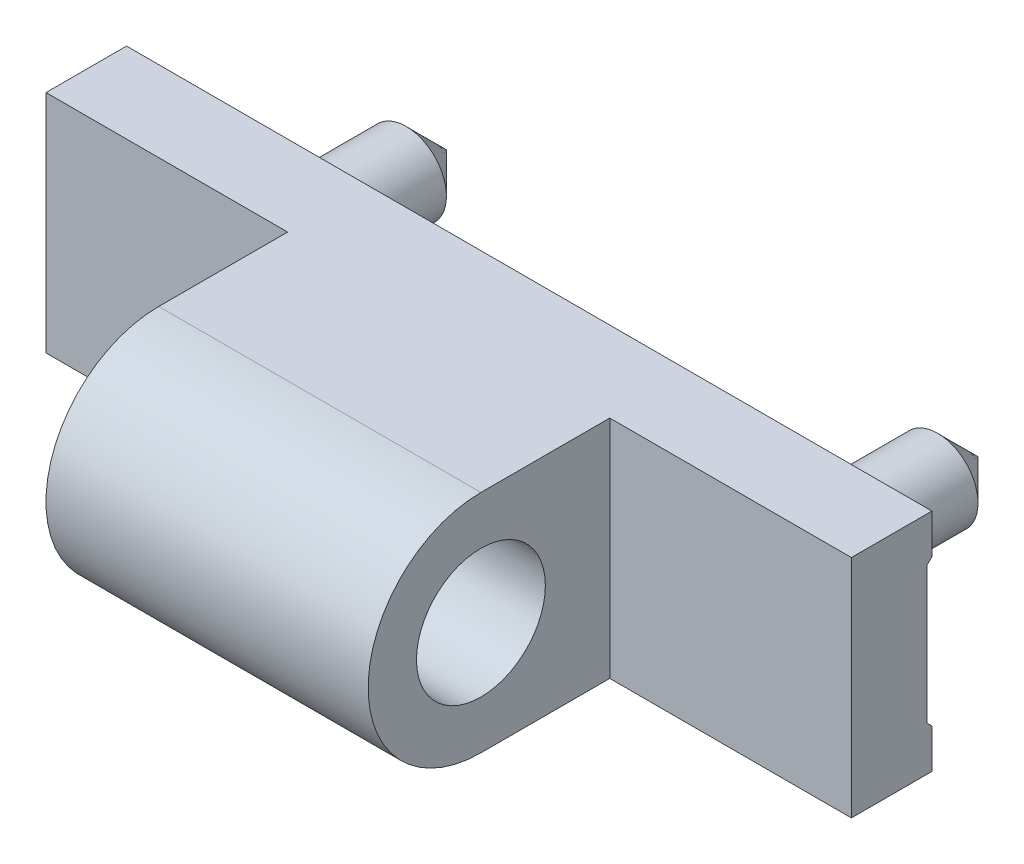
ISO-10303-21;
HEADER;
FILE_DESCRIPTION(('STEP AP214'),'2;1');
FILE_NAME('part.step','',(''),(''),'','','');
FILE_SCHEMA(('AUTOMOTIVE_DESIGN { 1 0 10303 214 1 1 1 1 }'));
ENDSEC;
DATA;
#1=APPLICATION_CONTEXT('core data for automotive mechanical design processes');
#2=APPLICATION_PROTOCOL_DEFINITION('international standard','automotive_design',2000,#1);
#3=PRODUCT_CONTEXT('',#1,'mechanical');
#4=PRODUCT('Part','Part','',(#3));
#5=PRODUCT_RELATED_PRODUCT_CATEGORY('part','',(#4));
#6=PRODUCT_DEFINITION_FORMATION('','',#4);
#7=PRODUCT_DEFINITION_CONTEXT('part definition',#1,'design');
#8=PRODUCT_DEFINITION('design','',#6,#7);
#9=PRODUCT_DEFINITION_SHAPE('','',#8);
#10=(LENGTH_UNIT() NAMED_UNIT(*) SI_UNIT(.MILLI.,.METRE.));
#11=(NAMED_UNIT(*) PLANE_ANGLE_UNIT() SI_UNIT($,.RADIAN.));
#12=(NAMED_UNIT(*) SI_UNIT($,.STERADIAN.) SOLID_ANGLE_UNIT());
#13=UNCERTAINTY_MEASURE_WITH_UNIT(LENGTH_MEASURE(1.E-05),#10,'distance_accuracy_value','');
#14=(GEOMETRIC_REPRESENTATION_CONTEXT(3) GLOBAL_UNCERTAINTY_ASSIGNED_CONTEXT((#13)) GLOBAL_UNIT_ASSIGNED_CONTEXT((#10,
#11,#12)) REPRESENTATION_CONTEXT('',''));
#15=CARTESIAN_POINT('',(0.,0.,0.));
#16=DIRECTION('',(0.,0.,1.));
#17=DIRECTION('',(1.,0.,0.));
#18=AXIS2_PLACEMENT_3D('',#15,#16,#17);
#19=CARTESIAN_POINT('',(41.5,0.,13.));
#20=DIRECTION('',(-1.,0.,0.));
#21=DIRECTION('',(0.,-1.,0.));
#22=AXIS2_PLACEMENT_3D('',#19,#20,#21);
#23=CYLINDRICAL_SURFACE('',#22,7.);
#24=CARTESIAN_POINT('',(26.5,0.,13.));
#25=DIRECTION('',(1.,0.,0.));
#26=DIRECTION('',(0.,1.,0.));
#27=AXIS2_PLACEMENT_3D('',#24,#25,#26);
#28=CIRCLE('',#27,7.);
#29=CARTESIAN_POINT('',(26.5,7.,13.));
#30=VERTEX_POINT('',#29);
#31=CARTESIAN_POINT('',(26.5,-7.,13.));
#32=VERTEX_POINT('',#31);
#33=EDGE_CURVE('E146',#30,#32,#28,.T.);
#34=ORIENTED_EDGE('',*,*,#33,.F.);
#35=DIRECTION('',(-1.,0.,0.));
#36=VECTOR('',#35,1.);
#37=CARTESIAN_POINT('',(41.5,7.,13.));
#38=LINE('',#37,#36);
#39=CARTESIAN_POINT('',(6.5,7.,13.));
#40=VERTEX_POINT('',#39);
#41=EDGE_CURVE('E165',#30,#40,#38,.T.);
#42=ORIENTED_EDGE('',*,*,#41,.T.);
#43=CARTESIAN_POINT('',(6.5,0.,13.));
#44=DIRECTION('',(-1.,0.,0.));
#45=DIRECTION('',(0.,-1.,0.));
#46=AXIS2_PLACEMENT_3D('',#43,#44,#45);
#47=CIRCLE('',#46,7.);
#48=CARTESIAN_POINT('',(6.5,-7.,13.));
#49=VERTEX_POINT('',#48);
#50=EDGE_CURVE('E141',#49,#40,#47,.T.);
#51=ORIENTED_EDGE('',*,*,#50,.F.);
#52=DIRECTION('',(-1.,0.,0.));
#53=VECTOR('',#52,1.);
#54=CARTESIAN_POINT('',(41.5,-7.,13.));
#55=LINE('',#54,#53);
#56=EDGE_CURVE('E199',#32,#49,#55,.T.);
#57=ORIENTED_EDGE('',*,*,#56,.F.);
#58=EDGE_LOOP('',(#34,#42,#51,#57));
#59=FACE_BOUND('',#58,.T.);
#60=ADVANCED_FACE('F14',(#59),#23,.T.);
#61=CARTESIAN_POINT('',(41.5,-7.,13.));
#62=DIRECTION('',(0.,1.,0.));
#63=DIRECTION('',(-1.,0.,0.));
#64=AXIS2_PLACEMENT_3D('',#61,#62,#63);
#65=PLANE('',#64);
#66=DIRECTION('',(0.,0.,-1.));
#67=VECTOR('',#66,1.);
#68=CARTESIAN_POINT('',(6.5,-7.,25.));
#69=LINE('',#68,#67);
#70=CARTESIAN_POINT('',(6.5,-7.,5.));
#71=VERTEX_POINT('',#70);
#72=EDGE_CURVE('E131',#49,#71,#69,.T.);
#73=ORIENTED_EDGE('',*,*,#72,.T.);
#74=DIRECTION('',(1.,0.,0.));
#75=VECTOR('',#74,1.);
#76=CARTESIAN_POINT('',(-8.5,-7.,5.));
#77=LINE('',#76,#75);
#78=CARTESIAN_POINT('',(-8.5,-7.,5.));
#79=VERTEX_POINT('',#78);
#80=EDGE_CURVE('E127',#79,#71,#77,.T.);
#81=ORIENTED_EDGE('',*,*,#80,.F.);
#82=DIRECTION('',(0.,0.,-1.));
#83=VECTOR('',#82,1.);
#84=CARTESIAN_POINT('',(-8.5,-7.,13.));
#85=LINE('',#84,#83);
#86=CARTESIAN_POINT('',(-8.5,-7.,0.));
#87=VERTEX_POINT('',#86);
#88=EDGE_CURVE('E148',#79,#87,#85,.T.);
#89=ORIENTED_EDGE('',*,*,#88,.T.);
#90=DIRECTION('',(-1.,0.,0.));
#91=VECTOR('',#90,1.);
#92=CARTESIAN_POINT('',(41.5,-7.,0.));
#93=LINE('',#92,#91);
#94=CARTESIAN_POINT('',(41.5,-7.,0.));
#95=VERTEX_POINT('',#94);
#96=EDGE_CURVE('E196',#95,#87,#93,.T.);
#97=ORIENTED_EDGE('',*,*,#96,.F.);
#98=DIRECTION('',(0.,0.,-1.));
#99=VECTOR('',#98,1.);
#100=CARTESIAN_POINT('',(41.5,-7.,13.));
#101=LINE('',#100,#99);
#102=CARTESIAN_POINT('',(41.5,-7.,5.));
#103=VERTEX_POINT('',#102);
#104=EDGE_CURVE('E149',#103,#95,#101,.T.);
#105=ORIENTED_EDGE('',*,*,#104,.F.);
#106=DIRECTION('',(1.,0.,0.));
#107=VECTOR('',#106,1.);
#108=CARTESIAN_POINT('',(26.5,-7.,5.));
#109=LINE('',#108,#107);
#110=CARTESIAN_POINT('',(26.5,-7.,5.));
#111=VERTEX_POINT('',#110);
#112=EDGE_CURVE('E28',#111,#103,#109,.T.);
#113=ORIENTED_EDGE('',*,*,#112,.F.);
#114=DIRECTION('',(0.,0.,-1.));
#115=VECTOR('',#114,1.);
#116=CARTESIAN_POINT('',(26.5,-7.,25.));
#117=LINE('',#116,#115);
#118=EDGE_CURVE('E134',#32,#111,#117,.T.);
#119=ORIENTED_EDGE('',*,*,#118,.F.);
#120=ORIENTED_EDGE('',*,*,#56,.T.);
#121=EDGE_LOOP('',(#73,#81,#89,#97,#105,#113,#119,#120));
#122=FACE_BOUND('',#121,.T.);
#123=ADVANCED_FACE('F254',(#122),#65,.F.);
#124=CARTESIAN_POINT('',(41.5,7.,0.));
#125=DIRECTION('',(0.,-1.,0.));
#126=DIRECTION('',(1.,0.,0.));
#127=AXIS2_PLACEMENT_3D('',#124,#125,#126);
#128=PLANE('',#127);
#129=DIRECTION('',(-1.,0.,0.));
#130=VECTOR('',#129,1.);
#131=CARTESIAN_POINT('',(41.5,7.,5.));
#132=LINE('',#131,#130);
#133=CARTESIAN_POINT('',(41.5,7.,5.));
#134=VERTEX_POINT('',#133);
#135=CARTESIAN_POINT('',(26.5,7.,5.));
#136=VERTEX_POINT('',#135);
#137=EDGE_CURVE('E137',#134,#136,#132,.T.);
#138=ORIENTED_EDGE('',*,*,#137,.F.);
#139=DIRECTION('',(0.,0.,1.));
#140=VECTOR('',#139,1.);
#141=CARTESIAN_POINT('',(41.5,7.,0.));
#142=LINE('',#141,#140);
#143=CARTESIAN_POINT('',(41.5,7.,0.));
#144=VERTEX_POINT('',#143);
#145=EDGE_CURVE('E162',#144,#134,#142,.T.);
#146=ORIENTED_EDGE('',*,*,#145,.F.);
#147=DIRECTION('',(-1.,0.,0.));
#148=VECTOR('',#147,1.);
#149=CARTESIAN_POINT('',(41.5,7.,0.));
#150=LINE('',#149,#148);
#151=CARTESIAN_POINT('',(-8.5,7.,0.));
#152=VERTEX_POINT('',#151);
#153=EDGE_CURVE('E181',#144,#152,#150,.T.);
#154=ORIENTED_EDGE('',*,*,#153,.T.);
#155=DIRECTION('',(0.,0.,1.));
#156=VECTOR('',#155,1.);
#157=CARTESIAN_POINT('',(-8.5,7.,0.));
#158=LINE('',#157,#156);
#159=CARTESIAN_POINT('',(-8.5,7.,5.));
#160=VERTEX_POINT('',#159);
#161=EDGE_CURVE('E152',#152,#160,#158,.T.);
#162=ORIENTED_EDGE('',*,*,#161,.T.);
#163=CARTESIAN_POINT('',(6.5,7.,5.));
#164=VERTEX_POINT('',#163);
#165=EDGE_CURVE('E36',#164,#160,#132,.T.);
#166=ORIENTED_EDGE('',*,*,#165,.F.);
#167=DIRECTION('',(0.,0.,-1.));
#168=VECTOR('',#167,1.);
#169=CARTESIAN_POINT('',(6.5,7.,0.));
#170=LINE('',#169,#168);
#171=EDGE_CURVE('E204',#40,#164,#170,.T.);
#172=ORIENTED_EDGE('',*,*,#171,.F.);
#173=ORIENTED_EDGE('',*,*,#41,.F.);
#174=DIRECTION('',(0.,0.,1.));
#175=VECTOR('',#174,1.);
#176=CARTESIAN_POINT('',(26.5,7.,0.));
#177=LINE('',#176,#175);
#178=EDGE_CURVE('E206',#136,#30,#177,.T.);
#179=ORIENTED_EDGE('',*,*,#178,.F.);
#180=EDGE_LOOP('',(#138,#146,#154,#162,#166,#172,#173,#179));
#181=FACE_BOUND('',#180,.T.);
#182=ADVANCED_FACE('F239',(#181),#128,.F.);
#183=CARTESIAN_POINT('',(41.5,0.,13.));
#184=DIRECTION('',(1.,0.,0.));
#185=DIRECTION('',(0.,1.,0.));
#186=AXIS2_PLACEMENT_3D('',#183,#184,#185);
#187=PLANE('',#186);
#188=ORIENTED_EDGE('',*,*,#145,.T.);
#189=DIRECTION('',(0.,1.,0.));
#190=VECTOR('',#189,1.);
#191=CARTESIAN_POINT('',(41.5,-7.,5.));
#192=LINE('',#191,#190);
#193=EDGE_CURVE('E125',#103,#134,#192,.T.);
#194=ORIENTED_EDGE('',*,*,#193,.F.);
#195=ORIENTED_EDGE('',*,*,#104,.T.);
#196=DIRECTION('',(0.,1.,0.));
#197=VECTOR('',#196,1.);
#198=CARTESIAN_POINT('',(41.5,-7.,0.));
#199=LINE('',#198,#197);
#200=CARTESIAN_POINT('',(41.5,-4.55,0.));
#201=VERTEX_POINT('',#200);
#202=EDGE_CURVE('E151',#95,#201,#199,.T.);
#203=ORIENTED_EDGE('',*,*,#202,.T.);
#204=DIRECTION('',(0.,0.707106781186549,0.707106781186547));
#205=VECTOR('',#204,1.);
#206=CARTESIAN_POINT('',(41.5,-4.55,0.));
#207=LINE('',#206,#205);
#208=CARTESIAN_POINT('',(41.5,-4.25,0.3));
#209=VERTEX_POINT('',#208);
#210=EDGE_CURVE('E154',#201,#209,#207,.T.);
#211=ORIENTED_EDGE('',*,*,#210,.T.);
#212=DIRECTION('',(0.,1.,0.));
#213=VECTOR('',#212,1.);
#214=CARTESIAN_POINT('',(41.5,-4.25,0.3));
#215=LINE('',#214,#213);
#216=CARTESIAN_POINT('',(41.5,4.25,0.3));
#217=VERTEX_POINT('',#216);
#218=EDGE_CURVE('E156',#209,#217,#215,.T.);
#219=ORIENTED_EDGE('',*,*,#218,.T.);
#220=DIRECTION('',(0.,0.707106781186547,-0.707106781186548));
#221=VECTOR('',#220,1.);
#222=CARTESIAN_POINT('',(41.5,4.25,0.3));
#223=LINE('',#222,#221);
#224=CARTESIAN_POINT('',(41.5,4.55,0.));
#225=VERTEX_POINT('',#224);
#226=EDGE_CURVE('E158',#217,#225,#223,.T.);
#227=ORIENTED_EDGE('',*,*,#226,.T.);
#228=DIRECTION('',(0.,1.,0.));
#229=VECTOR('',#228,1.);
#230=CARTESIAN_POINT('',(41.5,4.55,0.));
#231=LINE('',#230,#229);
#232=EDGE_CURVE('E160',#225,#144,#231,.T.);
#233=ORIENTED_EDGE('',*,*,#232,.T.);
#234=EDGE_LOOP('',(#188,#194,#195,#203,#211,#219,#227,#233));
#235=FACE_BOUND('',#234,.T.);
#236=ADVANCED_FACE('F242',(#235),#187,.T.);
#237=CARTESIAN_POINT('',(-8.5,0.,13.));
#238=DIRECTION('',(1.,0.,0.));
#239=DIRECTION('',(0.,1.,0.));
#240=AXIS2_PLACEMENT_3D('',#237,#238,#239);
#241=PLANE('',#240);
#242=DIRECTION('',(0.,-1.,0.));
#243=VECTOR('',#242,1.);
#244=CARTESIAN_POINT('',(-8.5,0.,5.));
#245=LINE('',#244,#243);
#246=EDGE_CURVE('E202',#160,#79,#245,.T.);
#247=ORIENTED_EDGE('',*,*,#246,.F.);
#248=ORIENTED_EDGE('',*,*,#161,.F.);
#249=DIRECTION('',(0.,1.,0.));
#250=VECTOR('',#249,1.);
#251=CARTESIAN_POINT('',(-8.5,4.55,0.));
#252=LINE('',#251,#250);
#253=CARTESIAN_POINT('',(-8.5,4.55,0.));
#254=VERTEX_POINT('',#253);
#255=EDGE_CURVE('E175',#254,#152,#252,.T.);
#256=ORIENTED_EDGE('',*,*,#255,.F.);
#257=DIRECTION('',(0.,0.707106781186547,-0.707106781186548));
#258=VECTOR('',#257,1.);
#259=CARTESIAN_POINT('',(-8.5,4.25,0.3));
#260=LINE('',#259,#258);
#261=CARTESIAN_POINT('',(-8.5,4.25,0.3));
#262=VERTEX_POINT('',#261);
#263=EDGE_CURVE('E173',#262,#254,#260,.T.);
#264=ORIENTED_EDGE('',*,*,#263,.F.);
#265=DIRECTION('',(0.,1.,0.));
#266=VECTOR('',#265,1.);
#267=CARTESIAN_POINT('',(-8.5,-4.25,0.3));
#268=LINE('',#267,#266);
#269=CARTESIAN_POINT('',(-8.5,-4.25,0.3));
#270=VERTEX_POINT('',#269);
#271=EDGE_CURVE('E171',#270,#262,#268,.T.);
#272=ORIENTED_EDGE('',*,*,#271,.F.);
#273=DIRECTION('',(0.,0.707106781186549,0.707106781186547));
#274=VECTOR('',#273,1.);
#275=CARTESIAN_POINT('',(-8.5,-4.55,0.));
#276=LINE('',#275,#274);
#277=CARTESIAN_POINT('',(-8.5,-4.55,0.));
#278=VERTEX_POINT('',#277);
#279=EDGE_CURVE('E169',#278,#270,#276,.T.);
#280=ORIENTED_EDGE('',*,*,#279,.F.);
#281=DIRECTION('',(0.,1.,0.));
#282=VECTOR('',#281,1.);
#283=CARTESIAN_POINT('',(-8.5,-7.,0.));
#284=LINE('',#283,#282);
#285=EDGE_CURVE('E167',#87,#278,#284,.T.);
#286=ORIENTED_EDGE('',*,*,#285,.F.);
#287=ORIENTED_EDGE('',*,*,#88,.F.);
#288=EDGE_LOOP('',(#247,#248,#256,#264,#272,#280,#286,#287));
#289=FACE_BOUND('',#288,.T.);
#290=ADVANCED_FACE('F230',(#289),#241,.F.);
#291=CARTESIAN_POINT('',(41.5,-7.,0.));
#292=DIRECTION('',(0.,0.,1.));
#293=DIRECTION('',(1.,0.,0.));
#294=AXIS2_PLACEMENT_3D('',#291,#292,#293);
#295=PLANE('',#294);
#296=ORIENTED_EDGE('',*,*,#285,.T.);
#297=DIRECTION('',(-1.,0.,0.));
#298=VECTOR('',#297,1.);
#299=CARTESIAN_POINT('',(41.5,-4.55,0.));
#300=LINE('',#299,#298);
#301=EDGE_CURVE('E193',#201,#278,#300,.T.);
#302=ORIENTED_EDGE('',*,*,#301,.F.);
#303=ORIENTED_EDGE('',*,*,#202,.F.);
#304=ORIENTED_EDGE('',*,*,#96,.T.);
#305=EDGE_LOOP('',(#296,#302,#303,#304));
#306=FACE_BOUND('',#305,.T.);
#307=ADVANCED_FACE('F251',(#306),#295,.F.);
#308=CARTESIAN_POINT('',(41.5,-4.55,0.));
#309=DIRECTION('',(0.,-0.707106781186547,0.707106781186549));
#310=DIRECTION('',(0.,-0.707106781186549,-0.707106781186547));
#311=AXIS2_PLACEMENT_3D('',#308,#309,#310);
#312=PLANE('',#311);
#313=ORIENTED_EDGE('',*,*,#279,.T.);
#314=DIRECTION('',(-1.,0.,0.));
#315=VECTOR('',#314,1.);
#316=CARTESIAN_POINT('',(41.5,-4.25,0.3));
#317=LINE('',#316,#315);
#318=EDGE_CURVE('E190',#209,#270,#317,.T.);
#319=ORIENTED_EDGE('',*,*,#318,.F.);
#320=ORIENTED_EDGE('',*,*,#210,.F.);
#321=ORIENTED_EDGE('',*,*,#301,.T.);
#322=EDGE_LOOP('',(#313,#319,#320,#321));
#323=FACE_BOUND('',#322,.T.);
#324=ADVANCED_FACE('F216',(#323),#312,.F.);
#325=CARTESIAN_POINT('',(41.5,-4.25,0.3));
#326=DIRECTION('',(0.,0.,1.));
#327=DIRECTION('',(1.,0.,0.));
#328=AXIS2_PLACEMENT_3D('',#325,#326,#327);
#329=PLANE('',#328);
#330=CARTESIAN_POINT('',(0.,0.,0.3));
#331=DIRECTION('',(0.,0.,1.));
#332=DIRECTION('',(1.,0.,0.));
#333=AXIS2_PLACEMENT_3D('',#330,#331,#332);
#334=CIRCLE('',#333,2.5);
#335=CARTESIAN_POINT('',(2.5,0.,0.3));
#336=VERTEX_POINT('',#335);
#337=EDGE_CURVE('E9',#336,#336,#334,.F.);
#338=ORIENTED_EDGE('',*,*,#337,.F.);
#339=EDGE_LOOP('',(#338));
#340=FACE_BOUND('',#339,.T.);
#341=CARTESIAN_POINT('',(33.,0.,0.3));
#342=DIRECTION('',(0.,0.,1.));
#343=DIRECTION('',(1.,0.,0.));
#344=AXIS2_PLACEMENT_3D('',#341,#342,#343);
#345=CIRCLE('',#344,2.5);
#346=CARTESIAN_POINT('',(35.5,0.,0.3));
#347=VERTEX_POINT('',#346);
#348=EDGE_CURVE('E21',#347,#347,#345,.F.);
#349=ORIENTED_EDGE('',*,*,#348,.F.);
#350=EDGE_LOOP('',(#349));
#351=FACE_BOUND('',#350,.T.);
#352=ORIENTED_EDGE('',*,*,#271,.T.);
#353=DIRECTION('',(-1.,0.,0.));
#354=VECTOR('',#353,1.);
#355=CARTESIAN_POINT('',(41.5,4.25,0.3));
#356=LINE('',#355,#354);
#357=EDGE_CURVE('E187',#217,#262,#356,.T.);
#358=ORIENTED_EDGE('',*,*,#357,.F.);
#359=ORIENTED_EDGE('',*,*,#218,.F.);
#360=ORIENTED_EDGE('',*,*,#318,.T.);
#361=EDGE_LOOP('',(#352,#358,#359,#360));
#362=FACE_BOUND('',#361,.T.);
#363=ADVANCED_FACE('F212',(#340,#351,#362),#329,.F.);
#364=CARTESIAN_POINT('',(41.5,4.25,0.3));
#365=DIRECTION('',(0.,0.707106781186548,0.707106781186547));
#366=DIRECTION('',(0.,-0.707106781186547,0.707106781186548));
#367=AXIS2_PLACEMENT_3D('',#364,#365,#366);
#368=PLANE('',#367);
#369=ORIENTED_EDGE('',*,*,#263,.T.);
#370=DIRECTION('',(-1.,0.,0.));
#371=VECTOR('',#370,1.);
#372=CARTESIAN_POINT('',(41.5,4.55,0.));
#373=LINE('',#372,#371);
#374=EDGE_CURVE('E184',#225,#254,#373,.T.);
#375=ORIENTED_EDGE('',*,*,#374,.F.);
#376=ORIENTED_EDGE('',*,*,#226,.F.);
#377=ORIENTED_EDGE('',*,*,#357,.T.);
#378=EDGE_LOOP('',(#369,#375,#376,#377));
#379=FACE_BOUND('',#378,.T.);
#380=ADVANCED_FACE('F215',(#379),#368,.F.);
#381=CARTESIAN_POINT('',(41.5,4.55,0.));
#382=DIRECTION('',(0.,0.,1.));
#383=DIRECTION('',(0.,-1.,0.));
#384=AXIS2_PLACEMENT_3D('',#381,#382,#383);
#385=PLANE('',#384);
#386=ORIENTED_EDGE('',*,*,#255,.T.);
#387=ORIENTED_EDGE('',*,*,#153,.F.);
#388=ORIENTED_EDGE('',*,*,#232,.F.);
#389=ORIENTED_EDGE('',*,*,#374,.T.);
#390=EDGE_LOOP('',(#386,#387,#388,#389));
#391=FACE_BOUND('',#390,.T.);
#392=ADVANCED_FACE('F234',(#391),#385,.F.);
#393=CARTESIAN_POINT('',(16.5,0.,5.));
#394=DIRECTION('',(0.,0.,1.));
#395=DIRECTION('',(1.,0.,0.));
#396=AXIS2_PLACEMENT_3D('',#393,#394,#395);
#397=PLANE('',#396);
#398=ORIENTED_EDGE('',*,*,#165,.T.);
#399=ORIENTED_EDGE('',*,*,#246,.T.);
#400=ORIENTED_EDGE('',*,*,#80,.T.);
#401=DIRECTION('',(0.,1.,0.));
#402=VECTOR('',#401,1.);
#403=CARTESIAN_POINT('',(6.5,-7.,5.));
#404=LINE('',#403,#402);
#405=EDGE_CURVE('E129',#71,#164,#404,.T.);
#406=ORIENTED_EDGE('',*,*,#405,.T.);
#407=EDGE_LOOP('',(#398,#399,#400,#406));
#408=FACE_BOUND('',#407,.T.);
#409=ADVANCED_FACE('F257',(#408),#397,.T.);
#410=CARTESIAN_POINT('',(6.5,-7.,25.));
#411=DIRECTION('',(-1.,0.,0.));
#412=DIRECTION('',(0.,-1.,0.));
#413=AXIS2_PLACEMENT_3D('',#410,#411,#412);
#414=PLANE('',#413);
#415=CARTESIAN_POINT('',(6.5,0.,13.));
#416=DIRECTION('',(-1.,0.,0.));
#417=DIRECTION('',(0.,-1.,0.));
#418=AXIS2_PLACEMENT_3D('',#415,#416,#417);
#419=CIRCLE('',#418,4.);
#420=CARTESIAN_POINT('',(6.5,-4.,13.));
#421=VERTEX_POINT('',#420);
#422=EDGE_CURVE('E138',#421,#421,#419,.T.);
#423=ORIENTED_EDGE('',*,*,#422,.F.);
#424=EDGE_LOOP('',(#423));
#425=FACE_BOUND('',#424,.T.);
#426=ORIENTED_EDGE('',*,*,#50,.T.);
#427=ORIENTED_EDGE('',*,*,#171,.T.);
#428=ORIENTED_EDGE('',*,*,#405,.F.);
#429=ORIENTED_EDGE('',*,*,#72,.F.);
#430=EDGE_LOOP('',(#426,#427,#428,#429));
#431=FACE_BOUND('',#430,.T.);
#432=ADVANCED_FACE('F259',(#425,#431),#414,.T.);
#433=CARTESIAN_POINT('',(26.5,7.,25.));
#434=DIRECTION('',(1.,0.,0.));
#435=DIRECTION('',(0.,1.,0.));
#436=AXIS2_PLACEMENT_3D('',#433,#434,#435);
#437=PLANE('',#436);
#438=CARTESIAN_POINT('',(26.5,0.,13.));
#439=DIRECTION('',(1.,0.,0.));
#440=DIRECTION('',(0.,1.,0.));
#441=AXIS2_PLACEMENT_3D('',#438,#439,#440);
#442=CIRCLE('',#441,4.);
#443=CARTESIAN_POINT('',(26.5,4.,13.));
#444=VERTEX_POINT('',#443);
#445=EDGE_CURVE('E143',#444,#444,#442,.T.);
#446=ORIENTED_EDGE('',*,*,#445,.F.);
#447=EDGE_LOOP('',(#446));
#448=FACE_BOUND('',#447,.T.);
#449=ORIENTED_EDGE('',*,*,#33,.T.);
#450=ORIENTED_EDGE('',*,*,#118,.T.);
#451=DIRECTION('',(0.,-1.,0.));
#452=VECTOR('',#451,1.);
#453=CARTESIAN_POINT('',(26.5,7.,5.));
#454=LINE('',#453,#452);
#455=EDGE_CURVE('E120',#136,#111,#454,.T.);
#456=ORIENTED_EDGE('',*,*,#455,.F.);
#457=ORIENTED_EDGE('',*,*,#178,.T.);
#458=EDGE_LOOP('',(#449,#450,#456,#457));
#459=FACE_BOUND('',#458,.T.);
#460=ADVANCED_FACE('F268',(#448,#459),#437,.T.);
#461=ORIENTED_EDGE('',*,*,#137,.T.);
#462=ORIENTED_EDGE('',*,*,#455,.T.);
#463=ORIENTED_EDGE('',*,*,#112,.T.);
#464=ORIENTED_EDGE('',*,*,#193,.T.);
#465=EDGE_LOOP('',(#461,#462,#463,#464));
#466=FACE_BOUND('',#465,.T.);
#467=ADVANCED_FACE('F270',(#466),#397,.T.);
#468=CARTESIAN_POINT('',(41.5,0.,13.));
#469=DIRECTION('',(-1.,0.,0.));
#470=DIRECTION('',(0.,-1.,0.));
#471=AXIS2_PLACEMENT_3D('',#468,#469,#470);
#472=CYLINDRICAL_SURFACE('',#471,4.);
#473=ORIENTED_EDGE('',*,*,#422,.T.);
#474=EDGE_LOOP('',(#473));
#475=FACE_BOUND('',#474,.T.);
#476=ORIENTED_EDGE('',*,*,#445,.T.);
#477=EDGE_LOOP('',(#476));
#478=FACE_BOUND('',#477,.T.);
#479=ADVANCED_FACE('F272',(#475,#478),#472,.F.);
#480=CARTESIAN_POINT('',(33.,0.,-11.36));
#481=DIRECTION('',(0.,0.,-1.));
#482=DIRECTION('',(-1.,0.,0.));
#483=AXIS2_PLACEMENT_3D('',#480,#481,#482);
#484=CYLINDRICAL_SURFACE('',#483,2.5);
#485=CARTESIAN_POINT('',(33.,0.,-8.86));
#486=DIRECTION('',(0.,0.,-1.));
#487=DIRECTION('',(-1.,0.,0.));
#488=AXIS2_PLACEMENT_3D('',#485,#486,#487);
#489=CIRCLE('',#488,2.5);
#490=CARTESIAN_POINT('',(30.5,0.,-8.86));
#491=VERTEX_POINT('',#490);
#492=EDGE_CURVE('E117',#491,#491,#489,.T.);
#493=ORIENTED_EDGE('',*,*,#492,.F.);
#494=EDGE_LOOP('',(#493));
#495=FACE_BOUND('',#494,.T.);
#496=ORIENTED_EDGE('',*,*,#348,.T.);
#497=EDGE_LOOP('',(#496));
#498=FACE_BOUND('',#497,.T.);
#499=ADVANCED_FACE('F210',(#495,#498),#484,.T.);
#500=CARTESIAN_POINT('',(33.,0.,-8.86));
#501=DIRECTION('',(0.,0.,1.));
#502=DIRECTION('',(1.,0.,0.));
#503=AXIS2_PLACEMENT_3D('',#500,#501,#502);
#504=CONICAL_SURFACE('',#503,2.5,0.785398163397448);
#505=CARTESIAN_POINT('',(33.,0.,-11.36));
#506=VERTEX_POINT('',#505);
#507=VERTEX_LOOP('',#506);
#508=FACE_BOUND('',#507,.T.);
#509=ORIENTED_EDGE('',*,*,#492,.T.);
#510=EDGE_LOOP('',(#509));
#511=FACE_BOUND('',#510,.T.);
#512=ADVANCED_FACE('F408',(#508,#511),#504,.T.);
#513=CARTESIAN_POINT('',(0.,0.,-11.36));
#514=DIRECTION('',(0.,0.,-1.));
#515=DIRECTION('',(-1.,0.,0.));
#516=AXIS2_PLACEMENT_3D('',#513,#514,#515);
#517=CYLINDRICAL_SURFACE('',#516,2.5);
#518=CARTESIAN_POINT('',(0.,0.,-8.86));
#519=DIRECTION('',(0.,0.,-1.));
#520=DIRECTION('',(-1.,0.,0.));
#521=AXIS2_PLACEMENT_3D('',#518,#519,#520);
#522=CIRCLE('',#521,2.5);
#523=CARTESIAN_POINT('',(-2.5,0.,-8.86));
#524=VERTEX_POINT('',#523);
#525=EDGE_CURVE('E115',#524,#524,#522,.T.);
#526=ORIENTED_EDGE('',*,*,#525,.F.);
#527=EDGE_LOOP('',(#526));
#528=FACE_BOUND('',#527,.T.);
#529=ORIENTED_EDGE('',*,*,#337,.T.);
#530=EDGE_LOOP('',(#529));
#531=FACE_BOUND('',#530,.T.);
#532=ADVANCED_FACE('F111',(#528,#531),#517,.T.);
#533=CARTESIAN_POINT('',(0.,0.,-8.86));
#534=DIRECTION('',(0.,0.,1.));
#535=DIRECTION('',(1.,0.,0.));
#536=AXIS2_PLACEMENT_3D('',#533,#534,#535);
#537=CONICAL_SURFACE('',#536,2.5,0.785398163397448);
#538=CARTESIAN_POINT('',(0.,0.,-11.36));
#539=VERTEX_POINT('',#538);
#540=VERTEX_LOOP('',#539);
#541=FACE_BOUND('',#540,.T.);
#542=ORIENTED_EDGE('',*,*,#525,.T.);
#543=EDGE_LOOP('',(#542));
#544=FACE_BOUND('',#543,.T.);
#545=ADVANCED_FACE('F108',(#541,#544),#537,.T.);
#546=CLOSED_SHELL('',(#60,#123,#182,#236,#290,#307,#324,#363,#380,#392,#409,#432,#460,#467,#479,
#499,#512,#532,#545));
#547=MANIFOLD_SOLID_BREP('B1',#546);
#548=ADVANCED_BREP_SHAPE_REPRESENTATION('',(#18,#547),#14);
#549=SHAPE_DEFINITION_REPRESENTATION(#9,#548);
ENDSEC;
END-ISO-10303-21;
